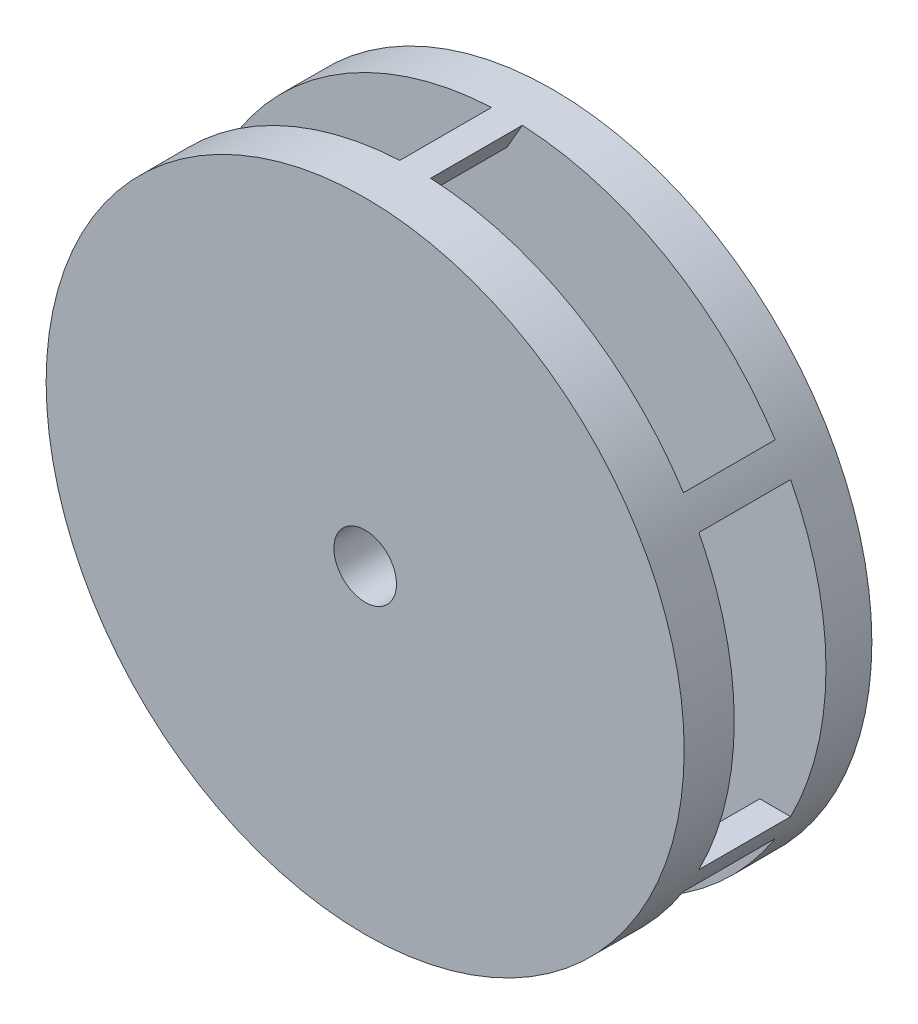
from build123d import *

# Parameters (mm, degrees)
CROQUIS1_R                 = 76.5
SALIENTE_EXTRUIR1_DEPTH    = 45
CROQUIS3_R                 = 30.5
CROQUIS3_R_2               = 25.5
SALIENTE_EXTRUIR2_DEPTH    = 15
CORTAR_EXTRUIR1_REACH      = 190.601
CORTAR_EXTRUIR1_END_RADIUS = 76.5
CORTAR_EXTRUIR2_DEPTH      = 174
CORTAR_EXTRUIR3_DEPTH      = 153
CORTAR_EXTRUIR4_REACH      = 119.173
CROQUIS9_R                 = 25.5
CORTAR_EXTRUIR5_REACH      = 125.711
CROQUIS10_R                = 7.5


with BuildPart() as part:
    # Croquis1 → Saliente-Extruir1 (new body)
    with BuildSketch(Plane.XY):
        with Locations(Location((0, 0, 0), (0, 0, 180))):
            Circle(CROQUIS1_R)
    extrude(amount=SALIENTE_EXTRUIR1_DEPTH)

    # Croquis3 → Saliente-Extruir2 (add)
    with BuildSketch(Plane(origin=(0, 0, 0), x_dir=(-1, 0, 0), z_dir=(0, 0, -1))):
        with Locations(Location((0, 0, 0), (0, 0, 180))):
            Circle(CROQUIS3_R)
        Circle(CROQUIS3_R_2, mode=Mode.SUBTRACT)
    extrude(amount=SALIENTE_EXTRUIR2_DEPTH)

    # Croquis4 → Revoluci_n1 (revolve)
    with BuildSketch(Plane(origin=(0, 0, 0), x_dir=(1, 0, 0), z_dir=(0, 1, 0)), mode=Mode.PRIVATE) as revoluci_n1_sk:
        with BuildLine():
            Line((-30.5, 0), (-65.5, 0))
            add(Edge.make_bspline(
                [(-65.5, 0), (-38.521374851, 2.276716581), (-30.5, 9)],
                knots=[0, 0, 0, 0.452791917, 0.452791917, 0.452791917], degree=2))
            Line((-30.5, 9), (-30.5, 0))
        make_face()
    revolve(revoluci_n1_sk.sketch.rotate(Axis((0, 0, 0), (0, 0, -1)), 180), axis=Axis((0, 0, 0), (0, 0, -1)))

    # Cortar-Extruir1: up to this cylinder (the profile starts inside it)
    cortar_extruir1_end = Plane(origin=(0, 0, 22), z_dir=(0, 0, -1)) * Cylinder(CORTAR_EXTRUIR1_END_RADIUS, 535.202, mode=Mode.PRIVATE)
    # Croquis6 → Cortar-Extruir1 (cut, up to the surface)
    with BuildSketch(Plane(origin=(38.25, -66.25094339, 0), x_dir=(0, 0, -1), z_dir=(0.499999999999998, -0.8660254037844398, 0)), mode=Mode.PRIVATE) as cortar_extruir1_sk1:
        Polygon((-11, 0), (-11, 35), (-33, 35), (-33, -35), (-11, -35), align=None)
    cortar_extruir1_tool1 = extrude(cortar_extruir1_sk1.sketch, amount=-CORTAR_EXTRUIR1_REACH, mode=Mode.PRIVATE) & cortar_extruir1_end
    add(cortar_extruir1_tool1.solids().sort_by_distance((38.25, -66.250943, 22))[0], mode=Mode.SUBTRACT)

    # Croquis7 → Cortar-Extruir2 (cut)
    with BuildSketch(Plane(origin=(38.25, 66.25094339, 0), x_dir=(0, 0, -1), z_dir=(0.5000000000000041, 0.8660254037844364, 0))):
        Polygon((-11, 0), (-11, 35), (-33, 35), (-33, -35), (-11, -35), align=None)
    extrude(amount=-CORTAR_EXTRUIR2_DEPTH, mode=Mode.SUBTRACT)

    # Croquis8 → Cortar-Extruir3 (cut)
    with BuildSketch(Plane(origin=(76.5, 0, 0), x_dir=(0, 0, -1), z_dir=(1, 0, 0))):
        Polygon((-11, 0), (-11, 35), (-33, 35), (-33, -35), (-11, -35), align=None)
    extrude(amount=-CORTAR_EXTRUIR3_DEPTH, mode=Mode.SUBTRACT)

    # Croquis9 → Cortar-Extruir4 (cut, up to next)
    with BuildSketch(Plane(origin=(0, 0, 0), x_dir=(-1, 0, 0), z_dir=(0, 0, -1)), mode=Mode.PRIVATE) as cortar_extruir4_sk1:
        Circle(CROQUIS9_R)
    cortar_extruir4_tool1 = extrude(cortar_extruir4_sk1.sketch, amount=-CORTAR_EXTRUIR4_REACH, mode=Mode.PRIVATE) & part.part
    add(cortar_extruir4_tool1.solids().sort_by_distance((0, 0, 0))[0], mode=Mode.SUBTRACT)

    # Croquis10 → Cortar-Extruir5 (cut, up to next)
    with BuildSketch(Plane.XY.offset(45), mode=Mode.PRIVATE) as cortar_extruir5_sk1:
        Circle(CROQUIS10_R)
    cortar_extruir5_tool1 = extrude(cortar_extruir5_sk1.sketch, amount=-CORTAR_EXTRUIR5_REACH, mode=Mode.PRIVATE) & part.part
    add(cortar_extruir5_tool1.solids().sort_by_distance((0, 0, 45))[0], mode=Mode.SUBTRACT)


solid = part.part
